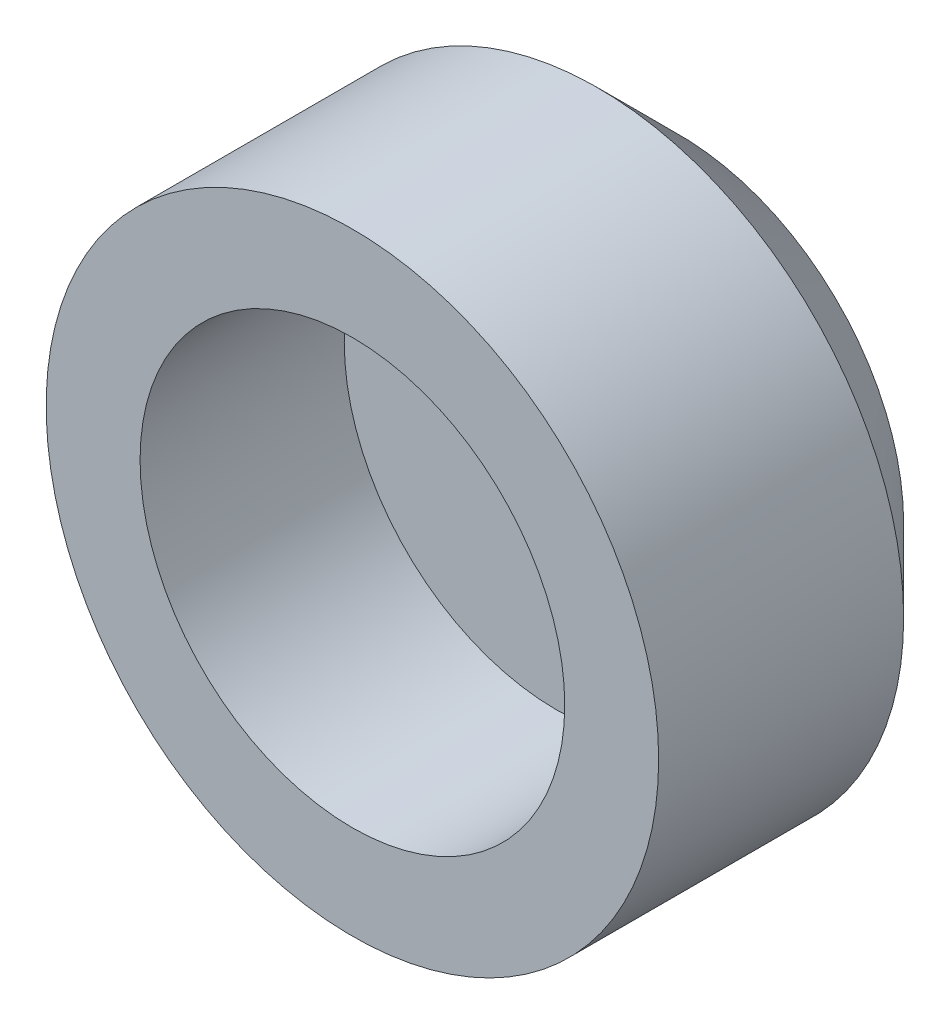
from build123d import *

# Parameters (mm, degrees)
SKETCH1_R           = 2.6
BOSS_EXTRUDE1_DEPTH = 1.5
SKETCH1_3_R         = 3.75
SKETCH1_3_R_2       = 2.6
BOSS_EXTRUDE2_DEPTH = 4
CHAMFER1_SIZE       = 1


with BuildPart() as part:
    # Sketch1 → Boss-Extrude1 (new body)
    with BuildSketch(Plane.XY):
        Circle(SKETCH1_R)
    extrude(amount=BOSS_EXTRUDE1_DEPTH)

    # Sketch1_3 → Boss-Extrude2 (add)
    with BuildSketch(Plane.XY):
        Circle(SKETCH1_3_R)
        Circle(SKETCH1_3_R_2, mode=Mode.SUBTRACT)
    extrude(amount=BOSS_EXTRUDE2_DEPTH)

    # Chamfer1
    chamfer1_edges = [part.edges().sort_by_distance(p)[0] for p in [
        (-3.75, 0, 0),
    ]]
    chamfer(chamfer1_edges, length=CHAMFER1_SIZE)


solid = part.part
